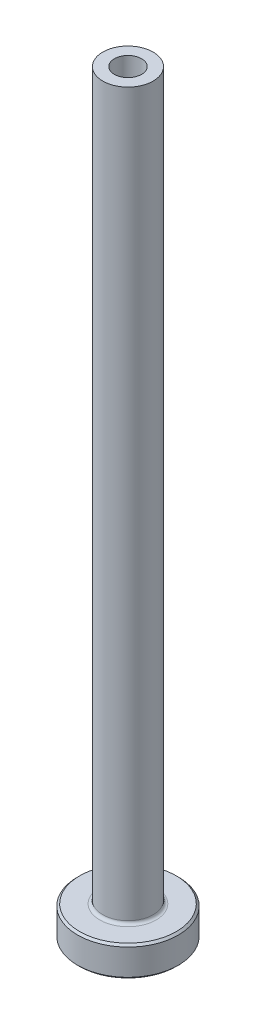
from build123d import *

# Parameters (mm, degrees)
FILLET1_R     = 0.3
CHAMFER1_SIZE = 0.2
CHAMFER3_SIZE = 0.5


with BuildPart() as part:
    # Sketch1 → Revolve1 (revolve)
    with BuildSketch(Plane.XY, mode=Mode.PRIVATE) as revolve1_sk:
        Polygon((-1.35, 75), (-2.5, 75), (-2.5, 3), (-5, 3), (-5, 0), (-1.6, 0), (-1.6, 18), (-1.35, 30), align=None)
    revolve(revolve1_sk.sketch.rotate(Axis((0, 92.187680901, 0), (0, -1, 0)), 270), axis=Axis((0, 92.187680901, 0), (0, -1, 0)))

    # Fillet1
    fillet1_edges = [part.edges().sort_by_distance(p)[0] for p in [
        (0, 3, -2.5),
    ]]
    fillet(fillet1_edges, radius=FILLET1_R)

    # Chamfer1
    chamfer1_edges = [part.edges().sort_by_distance(p)[0] for p in [
        (0, 0, -5),
        (0, 3, -5),
    ]]
    chamfer(chamfer1_edges, length=CHAMFER1_SIZE)

    # Chamfer3
    chamfer3_edges = [part.edges().sort_by_distance(p)[0] for p in [
        (0, 0, -1.6),
    ]]
    chamfer(chamfer3_edges, length=CHAMFER3_SIZE)


solid = part.part
